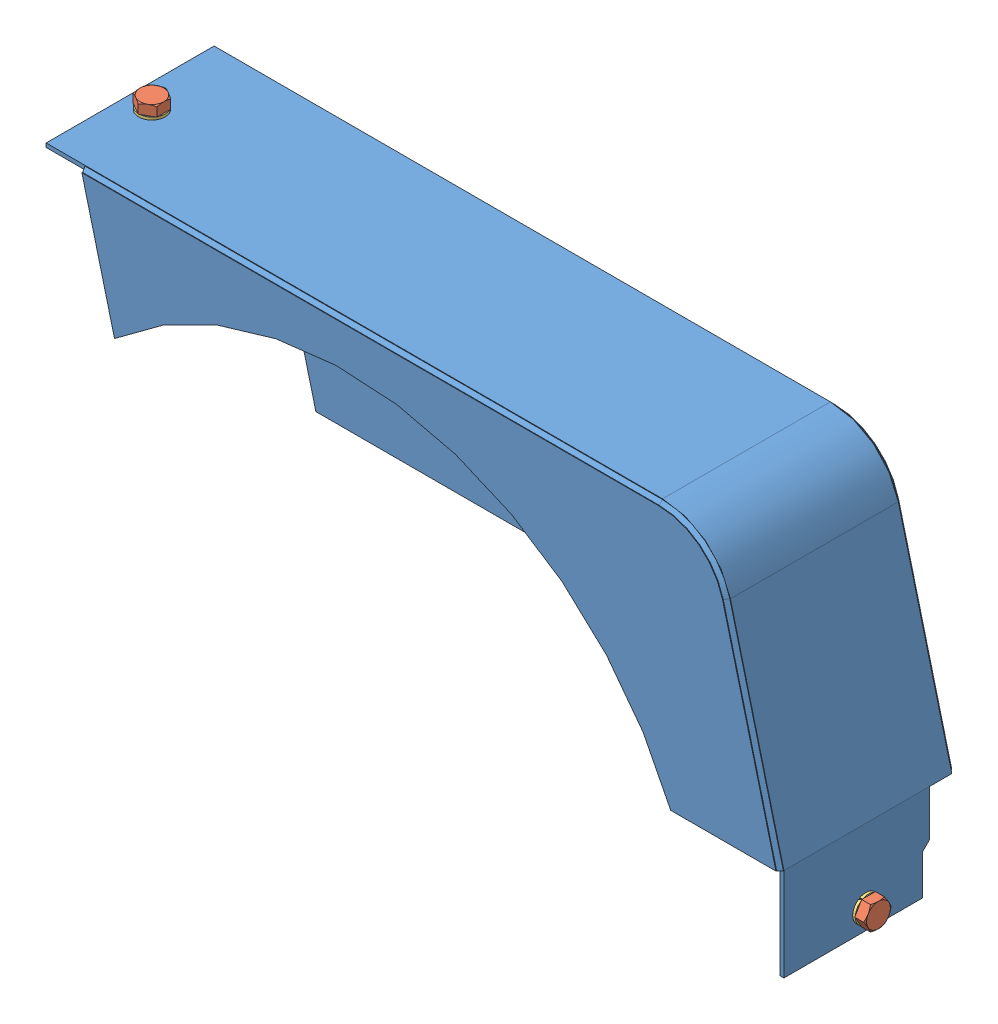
SolidWorks assembly 144 - carter droit - bande de frein avec vis.SLDASM, configuration Default (file format 3100). Lengths in mm.
Overall size (567.5 277.5 133).
7 component instances, 3 part files, 6 mates.
Components (placement in the parent):
- 144 - carter droit - bande de frein-1: 144 - carter droit - bande de frein.SLDPRT [Default<Brut d'usinage>] at (59.8065 91.9255 -94.0119) size (558 268 133)
- vis HM12 avec W12-1: vis HM12 avec W12.SLDASM [Default] at (-384.3383 136.8235 -25.9837) x (-0.5 0 -0.866025) z (0 -1 0) size (20 20.78 32.5)
  - VisHM12x25-1: VisHM12x25.SLDPRT [Défaut] at (0.3465 5.4562 -12.6397) size (18 20.78 32.5)
  - Rondelle_grower W12-1: Rondelle_grower W12.SLDPRT [Défaut] at (0.3465 5.4562 -12.6397) x (0 0 1) z (-1 0 0) size (2 20 20)
- vis HM12 avec W12-2: vis HM12 avec W12.SLDASM [Default] at (149.5739 -110.0887 -32.0401) x (0 -0.5 0.866025) z (-1 0 0) size (20 20.78 32.5)
  - VisHM12x25-1: VisHM12x25.SLDPRT [Défaut] at (0.3465 5.4562 -12.6397) size (18 20.78 32.5)
  - Rondelle_grower W12-1: Rondelle_grower W12.SLDPRT [Défaut] at (0.3465 5.4562 -12.6397) x (0 0 1) z (-1 0 0) size (2 20 20)
Mates (geometry in assembly coordinates):
- Coaxiale1: concentric anti-aligned: cylinder of 144 - carter droit - bande de frein-1; cylinder of vis HM12 avec W12-1/VisHM12x25-1
- Coïncidente1: coincident anti-aligned: plane of 144 - carter droit - bande de frein-1 through (-397.7864 147.4633 32.9881) normal (0 1 0); plane of vis HM12 avec W12-1/Rondelle_grower W12-1 through (-384.7864 147.4633 -37.6721) normal (0 -1 0)
- Parallèle1: parallel aligned: plane of 144 - carter droit - bande de frein-1 through (-397.7864 147.4633 32.9881) normal (-1 0 0); plane of vis HM12 avec W12-1/VisHM12x25-1 through (-388.7864 156.9633 -23.8157) normal (-1 0 0)
- Coaxiale2: concentric: cylinder of 144 - carter droit - bande de frein-1; cylinder of ?
- Coïncidente3: coincident: plane of 144 - carter droit - bande de frein-1 through (160.2136 -50.1582 32.9881) normal (1 0 0); plane of ? through (160.2136 -111.9395 -21.3305) normal (-1 0 0)
- Parallèle2: parallel aligned: plane of 144 - carter droit - bande de frein-1; plane of ?
